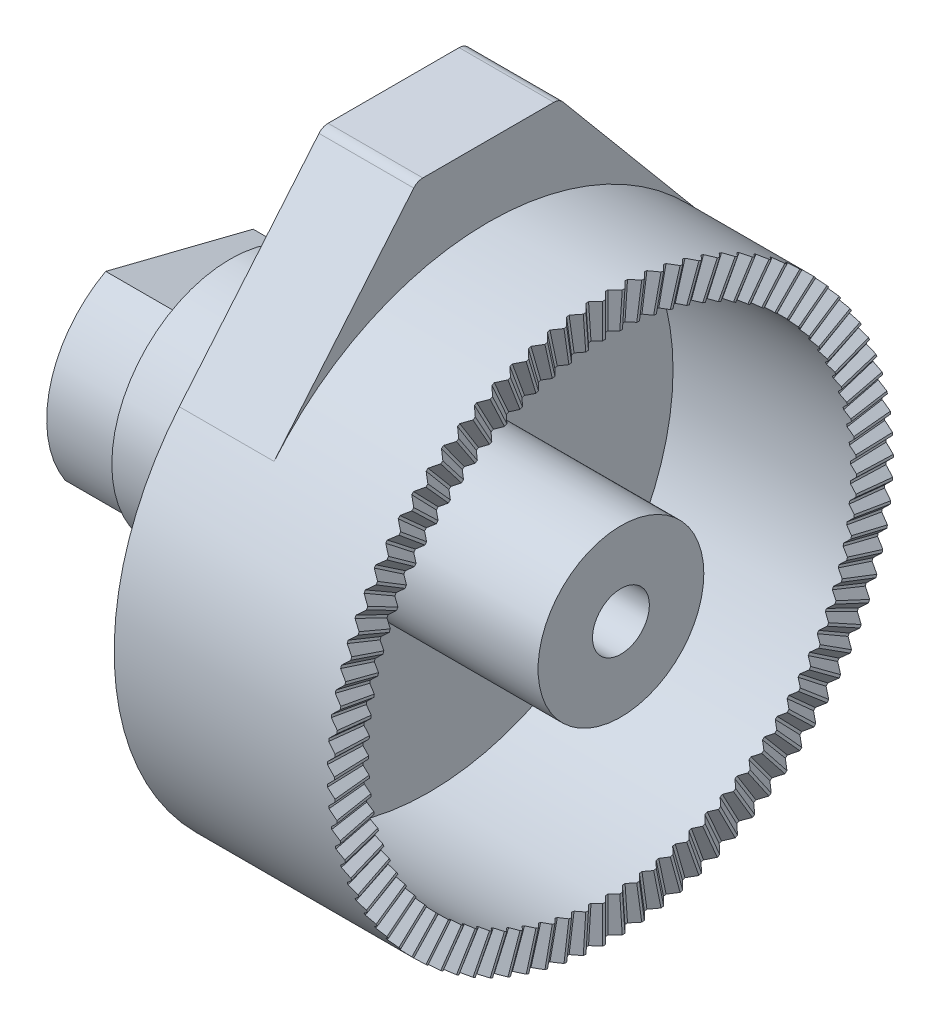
from build123d import *

# Parameters (mm, degrees)
BOSS_EXTRU_1_DEPTH                   = 4
ENL_V_DE_MAT_EXTRU_MINCE1_DEPTH      = 4
ENL_V_DE_MAT_EXTRU_MINCE1_DEPTH_BACK = 3
ENL_V_MAT_EXTRU_1_DEPTH              = 5
R_P_TITION_CIRCULAIRE1_COUNT         = 90


with BuildPart() as part:
    # Esquisse2 → Base-R_volution (revolve)
    with BuildSketch(Plane.XY, mode=Mode.PRIVATE) as base_r_volution_sk:
        Polygon((19.2, 11.8), (9.9, 11.8), (9.9, 5), (3, 5), (3, 4.75), (0, 4.75), (0, 1.2), (19.5, 1.2), (19.5, 3.5), (11.4, 3.5), (11.4, 10.3), (19.147618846, 10.3), align=None)
    revolve(base_r_volution_sk.sketch.rotate(Axis((33.952030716, 0, 0), (-1, 0, 0)), 90), axis=Axis((33.952030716, 0, 0), (-1, 0, 0)))

    # Esquisse3 → Boss.-Extru.1 (add)
    with BuildSketch(Plane.ZY.offset(-9.9)):
        with BuildLine():
            Line((-2.76647791, 14.8), (2.76647791, 14.8))
            ThreePointArc((2.76647791, 14.8), (2.978061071, 14.75302601), (3.149888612, 14.620930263))
            Line((3.149888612, 14.620930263), (9.04849256, 7.573954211))
            Line((9.04849256, 7.573954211), (7.27222233, 7.573954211))
            ThreePointArc((7.27222233, 7.573954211), (0, 10.5), (-7.27222233, 7.573954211))
            Line((-7.27222233, 7.573954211), (-9.04849256, 7.573954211))
            Line((-9.04849256, 7.573954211), (-3.149888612, 14.620930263))
            ThreePointArc((-3.149888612, 14.620930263), (-2.978061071, 14.75302601), (-2.76647791, 14.8))
        make_face()
    extrude(amount=-BOSS_EXTRU_1_DEPTH)

    # Esquisse4 → Enl_v. de mat.-Extru.-Mince1 (cut, two sides: drawn at the far end of the back side and taken through both)
    with BuildSketch(Plane.ZY.offset(-ENL_V_DE_MAT_EXTRU_MINCE1_DEPTH_BACK)):
        Polygon((-5.628027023, -5.02960486), (8.901424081, -1.363879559), (7.189010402, 5.423435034), (-7.340440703, 1.757709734), (-9.786745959, 11.453873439), (14.43886885, 17.565903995), (21.043893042, -8.613738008), (-3.181721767, -14.725768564), align=None)
    extrude(amount=ENL_V_DE_MAT_EXTRU_MINCE1_DEPTH + ENL_V_DE_MAT_EXTRU_MINCE1_DEPTH_BACK, mode=Mode.SUBTRACT)

    # Esquisse5 → Enl_v. mat.-Extru.1 (cut)
    with BuildSketch(Plane(origin=(0, 12, 0), x_dir=(-1, 0, 0), z_dir=(0, 1, 0))):
        Polygon((-18.9, -0.055), (-18.9, 0.055), (-19.916518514, 1.071518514), (-19.916518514, -1.071518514), align=None)
    enl_v_mat_extru_1 = extrude(amount=-ENL_V_MAT_EXTRU_1_DEPTH, mode=Mode.SUBTRACT)

    # R_p_tition circulaire1: Enl_v. mat.-Extru.1 ×90 about axis
    r_p_tition_circulaire1_axis = Axis((33.952030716, 0, 0), (-1, 0, 0))
    for i in range(1, R_P_TITION_CIRCULAIRE1_COUNT):
        add(enl_v_mat_extru_1.rotate(r_p_tition_circulaire1_axis, i * 360 / R_P_TITION_CIRCULAIRE1_COUNT), mode=Mode.SUBTRACT)


solid = part.part
